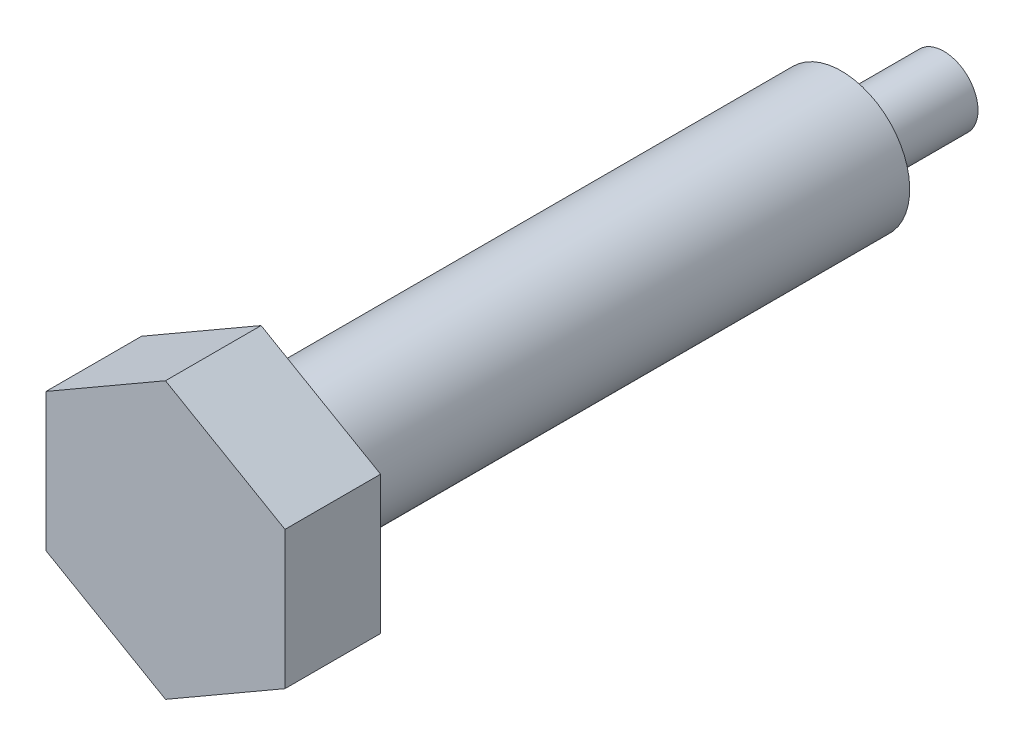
ISO-10303-21;
HEADER;
FILE_DESCRIPTION(('STEP AP214'),'2;1');
FILE_NAME('part.step','',(''),(''),'','','');
FILE_SCHEMA(('AUTOMOTIVE_DESIGN { 1 0 10303 214 1 1 1 1 }'));
ENDSEC;
DATA;
#1=APPLICATION_CONTEXT('core data for automotive mechanical design processes');
#2=APPLICATION_PROTOCOL_DEFINITION('international standard','automotive_design',2000,#1);
#3=PRODUCT_CONTEXT('',#1,'mechanical');
#4=PRODUCT('Part','Part','',(#3));
#5=PRODUCT_RELATED_PRODUCT_CATEGORY('part','',(#4));
#6=PRODUCT_DEFINITION_FORMATION('','',#4);
#7=PRODUCT_DEFINITION_CONTEXT('part definition',#1,'design');
#8=PRODUCT_DEFINITION('design','',#6,#7);
#9=PRODUCT_DEFINITION_SHAPE('','',#8);
#10=(LENGTH_UNIT() NAMED_UNIT(*) SI_UNIT(.MILLI.,.METRE.));
#11=(NAMED_UNIT(*) PLANE_ANGLE_UNIT() SI_UNIT($,.RADIAN.));
#12=(NAMED_UNIT(*) SI_UNIT($,.STERADIAN.) SOLID_ANGLE_UNIT());
#13=UNCERTAINTY_MEASURE_WITH_UNIT(LENGTH_MEASURE(1.E-05),#10,'distance_accuracy_value','');
#14=(GEOMETRIC_REPRESENTATION_CONTEXT(3) GLOBAL_UNCERTAINTY_ASSIGNED_CONTEXT((#13)) GLOBAL_UNIT_ASSIGNED_CONTEXT((#10,
#11,#12)) REPRESENTATION_CONTEXT('',''));
#15=CARTESIAN_POINT('',(0.,0.,0.));
#16=DIRECTION('',(0.,0.,1.));
#17=DIRECTION('',(1.,0.,0.));
#18=AXIS2_PLACEMENT_3D('',#15,#16,#17);
#19=CARTESIAN_POINT('',(7.,0.,0.));
#20=DIRECTION('',(0.,0.,-1.));
#21=DIRECTION('',(0.,1.,0.));
#22=AXIS2_PLACEMENT_3D('',#19,#20,#21);
#23=PLANE('',#22);
#24=DIRECTION('',(-0.866025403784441,0.5,0.));
#25=VECTOR('',#24,1.);
#26=CARTESIAN_POINT('',(3.5,2.02072594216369,0.));
#27=LINE('',#26,#25);
#28=CARTESIAN_POINT('',(3.5,2.02072594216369,0.));
#29=VERTEX_POINT('',#28);
#30=CARTESIAN_POINT('',(0.,4.04145188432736,0.));
#31=VERTEX_POINT('',#30);
#32=EDGE_CURVE('E71',#29,#31,#27,.T.);
#33=ORIENTED_EDGE('',*,*,#32,.F.);
#34=DIRECTION('',(0.,1.,0.));
#35=VECTOR('',#34,1.);
#36=CARTESIAN_POINT('',(3.5,-2.0207259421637,0.));
#37=LINE('',#36,#35);
#38=CARTESIAN_POINT('',(3.5,-2.0207259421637,0.));
#39=VERTEX_POINT('',#38);
#40=EDGE_CURVE('E97',#39,#29,#37,.T.);
#41=ORIENTED_EDGE('',*,*,#40,.F.);
#42=DIRECTION('',(0.86602540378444,0.5,0.));
#43=VECTOR('',#42,1.);
#44=CARTESIAN_POINT('',(0.,-4.04145188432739,0.));
#45=LINE('',#44,#43);
#46=CARTESIAN_POINT('',(0.,-4.04145188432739,0.));
#47=VERTEX_POINT('',#46);
#48=EDGE_CURVE('E95',#47,#39,#45,.T.);
#49=ORIENTED_EDGE('',*,*,#48,.F.);
#50=DIRECTION('',(0.866025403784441,-0.5,0.));
#51=VECTOR('',#50,1.);
#52=CARTESIAN_POINT('',(-3.5,-2.02072594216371,0.));
#53=LINE('',#52,#51);
#54=CARTESIAN_POINT('',(-3.5,-2.02072594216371,0.));
#55=VERTEX_POINT('',#54);
#56=EDGE_CURVE('E93',#55,#47,#53,.T.);
#57=ORIENTED_EDGE('',*,*,#56,.F.);
#58=DIRECTION('',(0.,-1.,0.));
#59=VECTOR('',#58,1.);
#60=CARTESIAN_POINT('',(-3.5,2.02072594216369,0.));
#61=LINE('',#60,#59);
#62=CARTESIAN_POINT('',(-3.5,2.02072594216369,0.));
#63=VERTEX_POINT('',#62);
#64=EDGE_CURVE('E73',#63,#55,#61,.T.);
#65=ORIENTED_EDGE('',*,*,#64,.F.);
#66=DIRECTION('',(-0.86602540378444,-0.5,0.));
#67=VECTOR('',#66,1.);
#68=CARTESIAN_POINT('',(0.,4.04145188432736,0.));
#69=LINE('',#68,#67);
#70=EDGE_CURVE('E67',#31,#63,#69,.T.);
#71=ORIENTED_EDGE('',*,*,#70,.F.);
#72=EDGE_LOOP('',(#33,#41,#49,#57,#65,#71));
#73=FACE_BOUND('',#72,.T.);
#74=CARTESIAN_POINT('',(0.,0.,0.));
#75=DIRECTION('',(0.,0.,1.));
#76=DIRECTION('',(0.,-1.,0.));
#77=AXIS2_PLACEMENT_3D('',#74,#75,#76);
#78=CIRCLE('',#77,2.);
#79=CARTESIAN_POINT('',(0.,-2.,0.));
#80=VERTEX_POINT('',#79);
#81=EDGE_CURVE('E85',#80,#80,#78,.T.);
#82=ORIENTED_EDGE('',*,*,#81,.T.);
#83=EDGE_LOOP('',(#82));
#84=FACE_BOUND('',#83,.T.);
#85=ADVANCED_FACE('F14',(#73,#84),#23,.T.);
#86=CARTESIAN_POINT('',(3.5,2.02072594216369,2.8));
#87=DIRECTION('',(-0.5,-0.866025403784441,0.));
#88=DIRECTION('',(0.866025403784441,-0.5,0.));
#89=AXIS2_PLACEMENT_3D('',#86,#87,#88);
#90=PLANE('',#89);
#91=ORIENTED_EDGE('',*,*,#32,.T.);
#92=DIRECTION('',(0.,0.,-1.));
#93=VECTOR('',#92,1.);
#94=CARTESIAN_POINT('',(0.,4.04145188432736,2.8));
#95=LINE('',#94,#93);
#96=CARTESIAN_POINT('',(0.,4.04145188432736,2.8));
#97=VERTEX_POINT('',#96);
#98=EDGE_CURVE('E9',#97,#31,#95,.T.);
#99=ORIENTED_EDGE('',*,*,#98,.F.);
#100=DIRECTION('',(-0.866025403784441,0.5,0.));
#101=VECTOR('',#100,1.);
#102=CARTESIAN_POINT('',(3.5,2.02072594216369,2.8));
#103=LINE('',#102,#101);
#104=CARTESIAN_POINT('',(3.5,2.02072594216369,2.8));
#105=VERTEX_POINT('',#104);
#106=EDGE_CURVE('E99',#105,#97,#103,.T.);
#107=ORIENTED_EDGE('',*,*,#106,.F.);
#108=DIRECTION('',(0.,0.,-1.));
#109=VECTOR('',#108,1.);
#110=CARTESIAN_POINT('',(3.5,2.02072594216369,2.8));
#111=LINE('',#110,#109);
#112=EDGE_CURVE('E84',#105,#29,#111,.T.);
#113=ORIENTED_EDGE('',*,*,#112,.T.);
#114=EDGE_LOOP('',(#91,#99,#107,#113));
#115=FACE_BOUND('',#114,.T.);
#116=ADVANCED_FACE('F16',(#115),#90,.F.);
#117=CARTESIAN_POINT('',(0.,4.04145188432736,2.8));
#118=DIRECTION('',(0.5,-0.86602540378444,0.));
#119=DIRECTION('',(0.86602540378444,0.5,0.));
#120=AXIS2_PLACEMENT_3D('',#117,#118,#119);
#121=PLANE('',#120);
#122=ORIENTED_EDGE('',*,*,#70,.T.);
#123=DIRECTION('',(0.,0.,-1.));
#124=VECTOR('',#123,1.);
#125=CARTESIAN_POINT('',(-3.5,2.02072594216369,2.8));
#126=LINE('',#125,#124);
#127=CARTESIAN_POINT('',(-3.5,2.02072594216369,2.8));
#128=VERTEX_POINT('',#127);
#129=EDGE_CURVE('E22',#128,#63,#126,.T.);
#130=ORIENTED_EDGE('',*,*,#129,.F.);
#131=DIRECTION('',(-0.86602540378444,-0.5,0.));
#132=VECTOR('',#131,1.);
#133=CARTESIAN_POINT('',(0.,4.04145188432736,2.8));
#134=LINE('',#133,#132);
#135=EDGE_CURVE('E80',#97,#128,#134,.T.);
#136=ORIENTED_EDGE('',*,*,#135,.F.);
#137=ORIENTED_EDGE('',*,*,#98,.T.);
#138=EDGE_LOOP('',(#122,#130,#136,#137));
#139=FACE_BOUND('',#138,.T.);
#140=ADVANCED_FACE('F79',(#139),#121,.F.);
#141=CARTESIAN_POINT('',(-3.5,2.02072594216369,2.8));
#142=DIRECTION('',(1.,0.,0.));
#143=DIRECTION('',(0.,1.,0.));
#144=AXIS2_PLACEMENT_3D('',#141,#142,#143);
#145=PLANE('',#144);
#146=ORIENTED_EDGE('',*,*,#64,.T.);
#147=DIRECTION('',(0.,0.,-1.));
#148=VECTOR('',#147,1.);
#149=CARTESIAN_POINT('',(-3.5,-2.02072594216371,2.8));
#150=LINE('',#149,#148);
#151=CARTESIAN_POINT('',(-3.5,-2.02072594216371,2.8));
#152=VERTEX_POINT('',#151);
#153=EDGE_CURVE('E115',#152,#55,#150,.T.);
#154=ORIENTED_EDGE('',*,*,#153,.F.);
#155=DIRECTION('',(0.,-1.,0.));
#156=VECTOR('',#155,1.);
#157=CARTESIAN_POINT('',(-3.5,2.02072594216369,2.8));
#158=LINE('',#157,#156);
#159=EDGE_CURVE('E102',#128,#152,#158,.T.);
#160=ORIENTED_EDGE('',*,*,#159,.F.);
#161=ORIENTED_EDGE('',*,*,#129,.T.);
#162=EDGE_LOOP('',(#146,#154,#160,#161));
#163=FACE_BOUND('',#162,.T.);
#164=ADVANCED_FACE('F119',(#163),#145,.F.);
#165=CARTESIAN_POINT('',(-3.5,-2.02072594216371,2.8));
#166=DIRECTION('',(0.5,0.866025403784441,0.));
#167=DIRECTION('',(-0.866025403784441,0.5,0.));
#168=AXIS2_PLACEMENT_3D('',#165,#166,#167);
#169=PLANE('',#168);
#170=ORIENTED_EDGE('',*,*,#56,.T.);
#171=DIRECTION('',(0.,0.,-1.));
#172=VECTOR('',#171,1.);
#173=CARTESIAN_POINT('',(0.,-4.04145188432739,2.8));
#174=LINE('',#173,#172);
#175=CARTESIAN_POINT('',(0.,-4.04145188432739,2.8));
#176=VERTEX_POINT('',#175);
#177=EDGE_CURVE('E112',#176,#47,#174,.T.);
#178=ORIENTED_EDGE('',*,*,#177,.F.);
#179=DIRECTION('',(0.866025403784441,-0.5,0.));
#180=VECTOR('',#179,1.);
#181=CARTESIAN_POINT('',(-3.5,-2.02072594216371,2.8));
#182=LINE('',#181,#180);
#183=EDGE_CURVE('E104',#152,#176,#182,.T.);
#184=ORIENTED_EDGE('',*,*,#183,.F.);
#185=ORIENTED_EDGE('',*,*,#153,.T.);
#186=EDGE_LOOP('',(#170,#178,#184,#185));
#187=FACE_BOUND('',#186,.T.);
#188=ADVANCED_FACE('F125',(#187),#169,.F.);
#189=CARTESIAN_POINT('',(0.,-4.04145188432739,2.8));
#190=DIRECTION('',(-0.5,0.86602540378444,0.));
#191=DIRECTION('',(-0.86602540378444,-0.5,0.));
#192=AXIS2_PLACEMENT_3D('',#189,#190,#191);
#193=PLANE('',#192);
#194=ORIENTED_EDGE('',*,*,#48,.T.);
#195=DIRECTION('',(0.,0.,-1.));
#196=VECTOR('',#195,1.);
#197=CARTESIAN_POINT('',(3.5,-2.0207259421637,2.8));
#198=LINE('',#197,#196);
#199=CARTESIAN_POINT('',(3.5,-2.0207259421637,2.8));
#200=VERTEX_POINT('',#199);
#201=EDGE_CURVE('E109',#200,#39,#198,.T.);
#202=ORIENTED_EDGE('',*,*,#201,.F.);
#203=DIRECTION('',(0.86602540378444,0.5,0.));
#204=VECTOR('',#203,1.);
#205=CARTESIAN_POINT('',(0.,-4.04145188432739,2.8));
#206=LINE('',#205,#204);
#207=EDGE_CURVE('E34',#176,#200,#206,.T.);
#208=ORIENTED_EDGE('',*,*,#207,.F.);
#209=ORIENTED_EDGE('',*,*,#177,.T.);
#210=EDGE_LOOP('',(#194,#202,#208,#209));
#211=FACE_BOUND('',#210,.T.);
#212=ADVANCED_FACE('F128',(#211),#193,.F.);
#213=CARTESIAN_POINT('',(3.5,-2.0207259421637,2.8));
#214=DIRECTION('',(-1.,0.,0.));
#215=DIRECTION('',(0.,-1.,0.));
#216=AXIS2_PLACEMENT_3D('',#213,#214,#215);
#217=PLANE('',#216);
#218=ORIENTED_EDGE('',*,*,#40,.T.);
#219=ORIENTED_EDGE('',*,*,#112,.F.);
#220=DIRECTION('',(0.,1.,0.));
#221=VECTOR('',#220,1.);
#222=CARTESIAN_POINT('',(3.5,-2.0207259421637,2.8));
#223=LINE('',#222,#221);
#224=EDGE_CURVE('E29',#200,#105,#223,.T.);
#225=ORIENTED_EDGE('',*,*,#224,.F.);
#226=ORIENTED_EDGE('',*,*,#201,.T.);
#227=EDGE_LOOP('',(#218,#219,#225,#226));
#228=FACE_BOUND('',#227,.T.);
#229=ADVANCED_FACE('F130',(#228),#217,.F.);
#230=CARTESIAN_POINT('',(7.,0.,2.8));
#231=DIRECTION('',(0.,0.,-1.));
#232=DIRECTION('',(0.,1.,0.));
#233=AXIS2_PLACEMENT_3D('',#230,#231,#232);
#234=PLANE('',#233);
#235=ORIENTED_EDGE('',*,*,#106,.T.);
#236=ORIENTED_EDGE('',*,*,#135,.T.);
#237=ORIENTED_EDGE('',*,*,#159,.T.);
#238=ORIENTED_EDGE('',*,*,#183,.T.);
#239=ORIENTED_EDGE('',*,*,#207,.T.);
#240=ORIENTED_EDGE('',*,*,#224,.T.);
#241=EDGE_LOOP('',(#235,#236,#237,#238,#239,#240));
#242=FACE_BOUND('',#241,.T.);
#243=ADVANCED_FACE('F122',(#242),#234,.F.);
#244=CARTESIAN_POINT('',(0.,0.,0.));
#245=DIRECTION('',(0.,0.,1.));
#246=DIRECTION('',(0.,-1.,0.));
#247=AXIS2_PLACEMENT_3D('',#244,#245,#246);
#248=CYLINDRICAL_SURFACE('',#247,2.);
#249=ORIENTED_EDGE('',*,*,#81,.F.);
#250=EDGE_LOOP('',(#249));
#251=FACE_BOUND('',#250,.T.);
#252=CARTESIAN_POINT('',(0.,0.,-17.));
#253=DIRECTION('',(0.,0.,1.));
#254=DIRECTION('',(0.,-1.,0.));
#255=AXIS2_PLACEMENT_3D('',#252,#253,#254);
#256=CIRCLE('',#255,2.);
#257=CARTESIAN_POINT('',(0.,-2.,-17.));
#258=VERTEX_POINT('',#257);
#259=EDGE_CURVE('E88',#258,#258,#256,.T.);
#260=ORIENTED_EDGE('',*,*,#259,.T.);
#261=EDGE_LOOP('',(#260));
#262=FACE_BOUND('',#261,.T.);
#263=ADVANCED_FACE('F138',(#251,#262),#248,.T.);
#264=CARTESIAN_POINT('',(0.,0.,-17.5773502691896));
#265=DIRECTION('',(0.,0.,1.));
#266=DIRECTION('',(0.,-1.,0.));
#267=AXIS2_PLACEMENT_3D('',#264,#265,#266);
#268=CONICAL_SURFACE('',#267,1.,1.0471975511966);
#269=ORIENTED_EDGE('',*,*,#259,.F.);
#270=EDGE_LOOP('',(#269));
#271=FACE_BOUND('',#270,.T.);
#272=CARTESIAN_POINT('',(0.,0.,-17.5773502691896));
#273=DIRECTION('',(0.,0.,1.));
#274=DIRECTION('',(0.,-1.,0.));
#275=AXIS2_PLACEMENT_3D('',#272,#273,#274);
#276=CIRCLE('',#275,1.);
#277=CARTESIAN_POINT('',(0.,-1.,-17.5773502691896));
#278=VERTEX_POINT('',#277);
#279=EDGE_CURVE('E167',#278,#278,#276,.T.);
#280=ORIENTED_EDGE('',*,*,#279,.T.);
#281=EDGE_LOOP('',(#280));
#282=FACE_BOUND('',#281,.T.);
#283=ADVANCED_FACE('F149',(#271,#282),#268,.T.);
#284=CARTESIAN_POINT('',(0.,0.,0.));
#285=DIRECTION('',(0.,0.,1.));
#286=DIRECTION('',(0.,-1.,0.));
#287=AXIS2_PLACEMENT_3D('',#284,#285,#286);
#288=CYLINDRICAL_SURFACE('',#287,1.);
#289=ORIENTED_EDGE('',*,*,#279,.F.);
#290=EDGE_LOOP('',(#289));
#291=FACE_BOUND('',#290,.T.);
#292=CARTESIAN_POINT('',(0.,0.,-20.));
#293=DIRECTION('',(0.,0.,1.));
#294=DIRECTION('',(0.,-1.,0.));
#295=AXIS2_PLACEMENT_3D('',#292,#293,#294);
#296=CIRCLE('',#295,1.);
#297=CARTESIAN_POINT('',(0.,-1.,-20.));
#298=VERTEX_POINT('',#297);
#299=EDGE_CURVE('E165',#298,#298,#296,.T.);
#300=ORIENTED_EDGE('',*,*,#299,.T.);
#301=EDGE_LOOP('',(#300));
#302=FACE_BOUND('',#301,.T.);
#303=ADVANCED_FACE('F153',(#291,#302),#288,.T.);
#304=CARTESIAN_POINT('',(0.,0.,-17.1715728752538));
#305=DIRECTION('',(0.,0.,1.));
#306=DIRECTION('',(1.,0.,0.));
#307=AXIS2_PLACEMENT_3D('',#304,#305,#306);
#308=SPHERICAL_SURFACE('',#307,3.);
#309=ORIENTED_EDGE('',*,*,#299,.F.);
#310=EDGE_LOOP('',(#309));
#311=FACE_BOUND('',#310,.T.);
#312=ADVANCED_FACE('F157',(#311),#308,.T.);
#313=CLOSED_SHELL('',(#85,#116,#140,#164,#188,#212,#229,#243,#263,#283,#303,#312));
#314=MANIFOLD_SOLID_BREP('B1',#313);
#315=ADVANCED_BREP_SHAPE_REPRESENTATION('',(#18,#314),#14);
#316=SHAPE_DEFINITION_REPRESENTATION(#9,#315);
ENDSEC;
END-ISO-10303-21;
